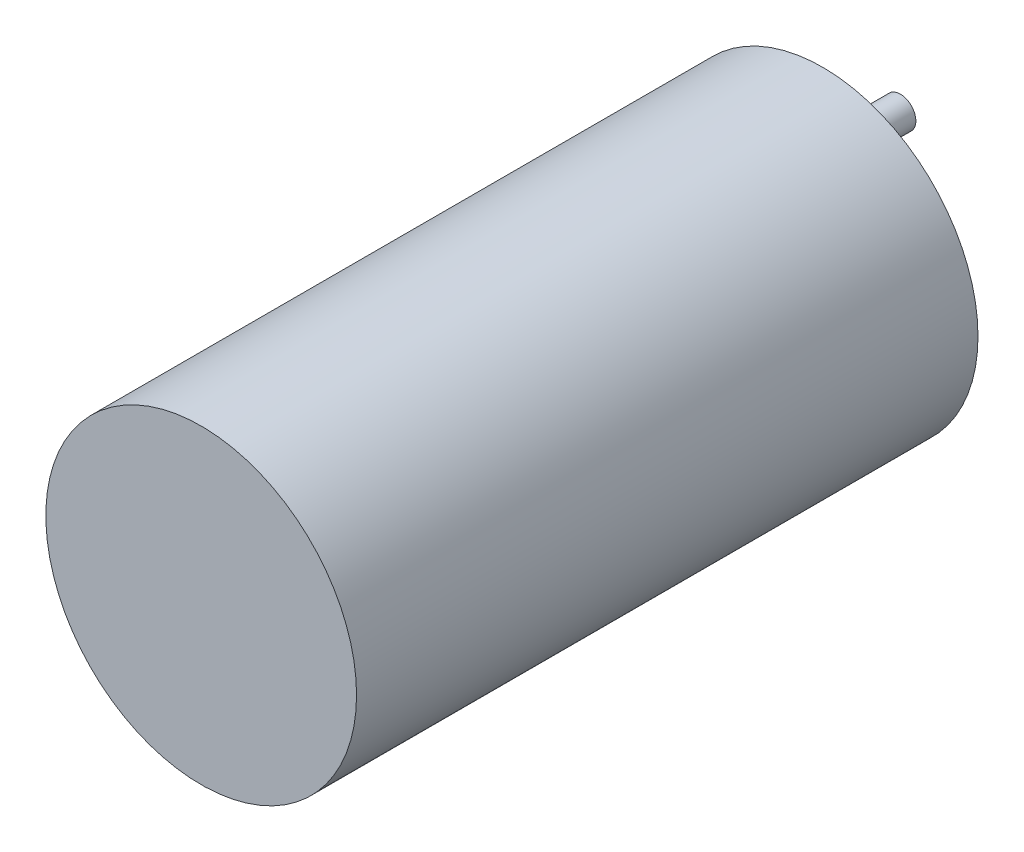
from build123d import *

# Parameters (mm, degrees)
SKETCH_1_R      = 5.08
EXTRUDE_1_DEPTH = 20.32
SKETCH_2_R      = 0.508
EXTRUDE_2_DEPTH = 2.54


with BuildPart() as part:
    # Sketch 1 → Extrude 1 (new body)
    with BuildSketch(Plane.XY):
        Circle(SKETCH_1_R)
    extrude(amount=EXTRUDE_1_DEPTH)

    # Sketch 2 → Extrude 2 (add)
    with BuildSketch(Plane(origin=(0, 0, 0), x_dir=(-1, 0, 0), z_dir=(0, 0, -1))):
        with Locations(Location((0, 2.54, 0), (0, 0, 180))):
            Circle(SKETCH_2_R)
        with Locations(Location((0, -2.54, 0), (0, 0, 180))):
            Circle(SKETCH_2_R)
    extrude(amount=EXTRUDE_2_DEPTH)


solid = part.part
